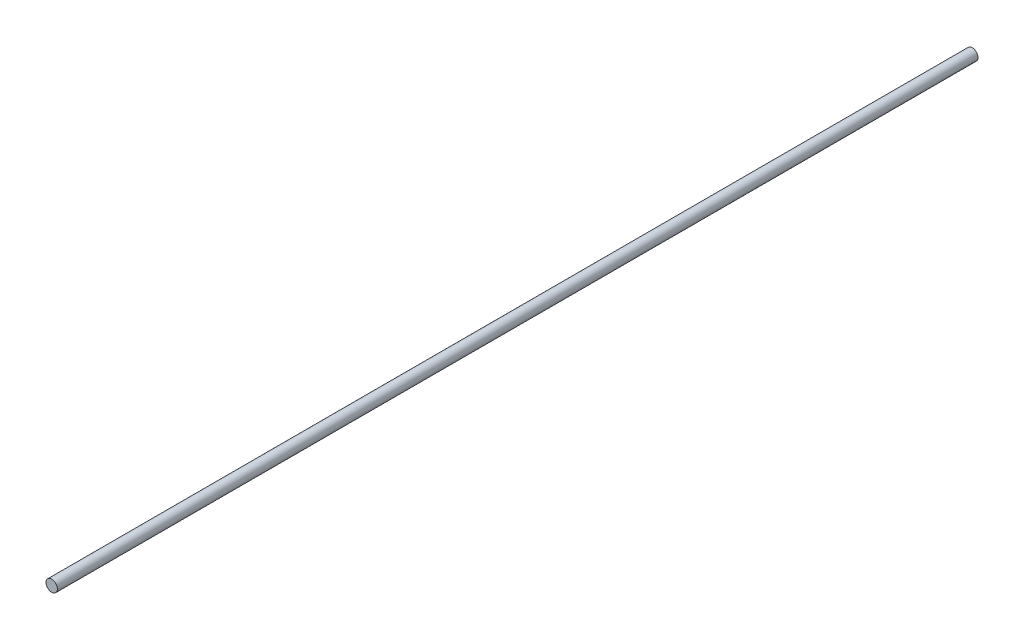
ISO-10303-21;
HEADER;
FILE_DESCRIPTION(('STEP AP214'),'2;1');
FILE_NAME('part.step','',(''),(''),'','','');
FILE_SCHEMA(('AUTOMOTIVE_DESIGN { 1 0 10303 214 1 1 1 1 }'));
ENDSEC;
DATA;
#1=APPLICATION_CONTEXT('core data for automotive mechanical design processes');
#2=APPLICATION_PROTOCOL_DEFINITION('international standard','automotive_design',2000,#1);
#3=PRODUCT_CONTEXT('',#1,'mechanical');
#4=PRODUCT('Part','Part','',(#3));
#5=PRODUCT_RELATED_PRODUCT_CATEGORY('part','',(#4));
#6=PRODUCT_DEFINITION_FORMATION('','',#4);
#7=PRODUCT_DEFINITION_CONTEXT('part definition',#1,'design');
#8=PRODUCT_DEFINITION('design','',#6,#7);
#9=PRODUCT_DEFINITION_SHAPE('','',#8);
#10=(LENGTH_UNIT() NAMED_UNIT(*) SI_UNIT(.MILLI.,.METRE.));
#11=(NAMED_UNIT(*) PLANE_ANGLE_UNIT() SI_UNIT($,.RADIAN.));
#12=(NAMED_UNIT(*) SI_UNIT($,.STERADIAN.) SOLID_ANGLE_UNIT());
#13=UNCERTAINTY_MEASURE_WITH_UNIT(LENGTH_MEASURE(1.E-05),#10,'distance_accuracy_value','');
#14=(GEOMETRIC_REPRESENTATION_CONTEXT(3) GLOBAL_UNCERTAINTY_ASSIGNED_CONTEXT((#13)) GLOBAL_UNIT_ASSIGNED_CONTEXT((#10,
#11,#12)) REPRESENTATION_CONTEXT('',''));
#15=CARTESIAN_POINT('',(0.,0.,0.));
#16=DIRECTION('',(0.,0.,1.));
#17=DIRECTION('',(1.,0.,0.));
#18=AXIS2_PLACEMENT_3D('',#15,#16,#17);
#19=CARTESIAN_POINT('',(0.,0.,-4850.));
#20=DIRECTION('',(0.,0.,1.));
#21=DIRECTION('',(1.,0.,0.));
#22=AXIS2_PLACEMENT_3D('',#19,#20,#21);
#23=CYLINDRICAL_SURFACE('',#22,30.);
#24=CARTESIAN_POINT('',(0.,0.,-4850.));
#25=DIRECTION('',(0.,0.,1.));
#26=DIRECTION('',(1.,0.,0.));
#27=AXIS2_PLACEMENT_3D('',#24,#25,#26);
#28=CIRCLE('',#27,30.);
#29=CARTESIAN_POINT('',(30.,0.,-4850.));
#30=VERTEX_POINT('',#29);
#31=EDGE_CURVE('E10',#30,#30,#28,.T.);
#32=ORIENTED_EDGE('',*,*,#31,.T.);
#33=EDGE_LOOP('',(#32));
#34=FACE_BOUND('',#33,.T.);
#35=CARTESIAN_POINT('',(0.,0.,0.));
#36=DIRECTION('',(0.,0.,1.));
#37=DIRECTION('',(1.,0.,0.));
#38=AXIS2_PLACEMENT_3D('',#35,#36,#37);
#39=CIRCLE('',#38,30.);
#40=CARTESIAN_POINT('',(30.,0.,0.));
#41=VERTEX_POINT('',#40);
#42=EDGE_CURVE('E40',#41,#41,#39,.T.);
#43=ORIENTED_EDGE('',*,*,#42,.F.);
#44=EDGE_LOOP('',(#43));
#45=FACE_BOUND('',#44,.T.);
#46=ADVANCED_FACE('F37',(#34,#45),#23,.T.);
#47=CARTESIAN_POINT('',(0.,0.,-4850.));
#48=DIRECTION('',(0.,0.,1.));
#49=DIRECTION('',(1.,0.,0.));
#50=AXIS2_PLACEMENT_3D('',#47,#48,#49);
#51=PLANE('',#50);
#52=ORIENTED_EDGE('',*,*,#31,.F.);
#53=EDGE_LOOP('',(#52));
#54=FACE_BOUND('',#53,.T.);
#55=ADVANCED_FACE('F54',(#54),#51,.F.);
#56=CARTESIAN_POINT('',(0.,0.,0.));
#57=DIRECTION('',(0.,0.,1.));
#58=DIRECTION('',(1.,0.,0.));
#59=AXIS2_PLACEMENT_3D('',#56,#57,#58);
#60=PLANE('',#59);
#61=ORIENTED_EDGE('',*,*,#42,.T.);
#62=EDGE_LOOP('',(#61));
#63=FACE_BOUND('',#62,.T.);
#64=ADVANCED_FACE('F51',(#63),#60,.T.);
#65=CLOSED_SHELL('',(#46,#55,#64));
#66=MANIFOLD_SOLID_BREP('B2',#65);
#67=ADVANCED_BREP_SHAPE_REPRESENTATION('',(#18,#66),#14);
#68=SHAPE_DEFINITION_REPRESENTATION(#9,#67);
ENDSEC;
END-ISO-10303-21;
